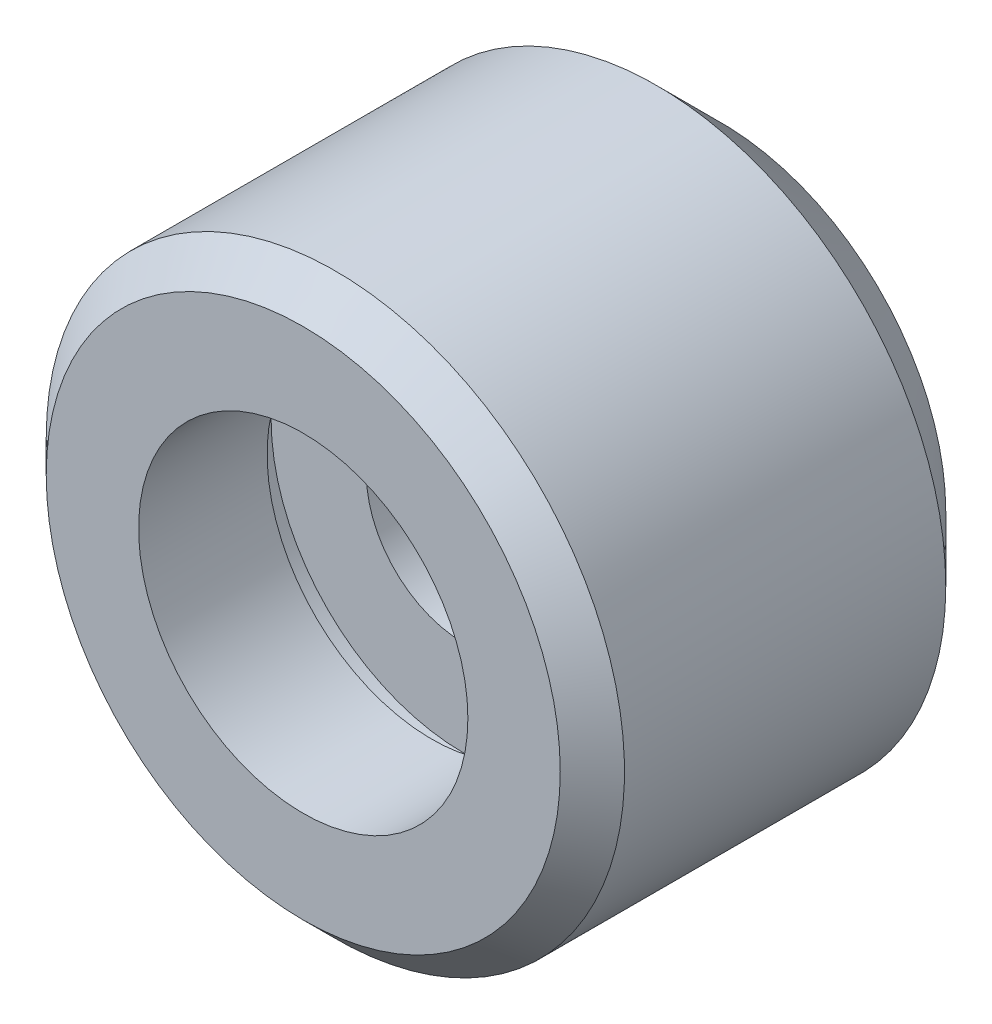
from build123d import *

# Parameters (mm, degrees)
ESQUISSE1_R             = 9
BASE_EXTRUSION_DEPTH    = 13
CHANFREIN1_SIZE         = 1
CHANFREIN2_SIZE         = 2
ESQUISSE2_R             = 5.125
ENL_V_MAT_EXTRU_1_DEPTH = 4
ESQUISSE3_R             = 6
ENL_V_MAT_EXTRU_2_DEPTH = 1
ESQUISSE4_R             = 3.035
ENL_V_MAT_EXTRU_3_DEPTH = 19.193405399


with BuildPart() as part:
    # Esquisse1 → Base-Extrusion (new body)
    with BuildSketch(Plane.XY):
        with Locations(Location((0, 0, 0), (0, 0, 180))):
            Circle(ESQUISSE1_R)
    extrude(amount=BASE_EXTRUSION_DEPTH)

    # Chanfrein1
    chanfrein1_edges = [part.edges().sort_by_distance(p)[0] for p in [
        (9, 0, 13),
    ]]
    chamfer(chanfrein1_edges, length=CHANFREIN1_SIZE)

    # Chanfrein2
    chanfrein2_edges = [part.edges().sort_by_distance(p)[0] for p in [
        (9, 0, 0),
    ]]
    chamfer(chanfrein2_edges, length=CHANFREIN2_SIZE)

    # Esquisse2 → Enl_v. mat.-Extru.1 (cut)
    with BuildSketch(Plane.XY.offset(13)):
        Circle(ESQUISSE2_R)
    extrude(amount=-ENL_V_MAT_EXTRU_1_DEPTH, mode=Mode.SUBTRACT)

    # Esquisse3 → Enl_v. mat.-Extru.2 (cut)
    with BuildSketch(Plane.XY.offset(9)):
        Circle(ESQUISSE3_R)
    extrude(amount=-ENL_V_MAT_EXTRU_2_DEPTH, mode=Mode.SUBTRACT)

    # Esquisse4 → Enl_v. mat.-Extru.3 (cut, through all)
    with BuildSketch(Plane(origin=(0, 0, 0), x_dir=(-1, 0, 0), z_dir=(0, 0, -1))):
        Circle(ESQUISSE4_R)
    extrude(amount=-ENL_V_MAT_EXTRU_3_DEPTH, mode=Mode.SUBTRACT)


solid = part.part
